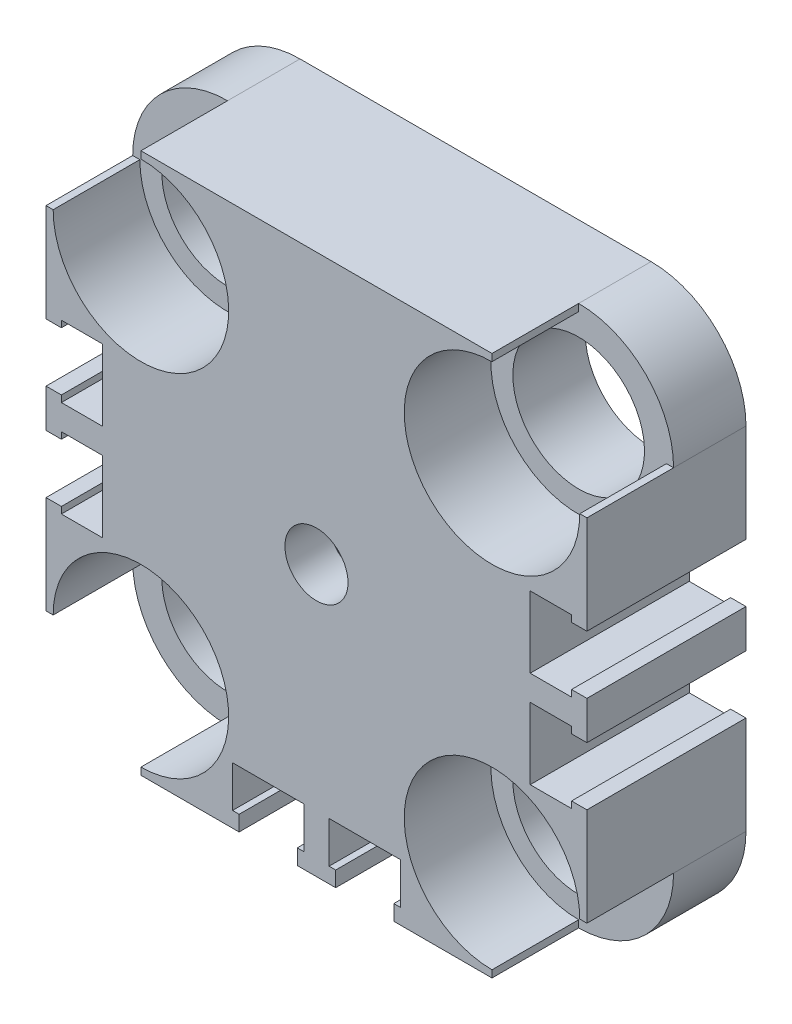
from build123d import *

# Parameters (mm, degrees)
EXTRUSION1_DEPTH                    = 14.5
ENL_V_MAT_EXTRU_1_DEPTH             = 7.9
ESQUISSE3_R                         = 6
ENL_V_MAT_EXTRU_2_DEPTH             = 7.9
R_P_TITION_CIRCULAIRE1_COUNT        = 4
ESQUISSE4_R                         = 2.875
ENL_V_MAT_EXTRU_3_DEPTH             = 4
ENL_V_MAT_EXTRU_4_DEPTH             = 38.755728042
R_P_TITION_CIRCULAIRE2_COUNT        = 3
R_P_TITION_CIRCULAIRE2_ANGLE        = 180
R_P_TITION_CIRCULAIRE2_COPY_1_DEPTH = 38.755728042
R_P_TITION_CIRCULAIRE2_COPY_2_DEPTH = 38.755728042


with BuildPart() as part:
    # Esquisse1 → Extrusion1 (new body)
    with BuildSketch(Plane.XY):
        with BuildLine():
            Line((-16, 24.65), (16, 24.65))
            ThreePointArc((16, 24.65), (22.116473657, 22.116473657), (24.65, 16))
            Line((24.65, 16), (24.65, -16))
            ThreePointArc((24.65, -16), (22.116473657, -22.116473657), (16, -24.65))
            Line((16, -24.65), (-16, -24.65))
            ThreePointArc((-16, -24.65), (-22.116473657, -22.116473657), (-24.65, -16))
            Line((-24.65, -16), (-24.65, 16))
            ThreePointArc((-24.65, 16), (-22.116473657, 22.116473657), (-16, 24.65))
        make_face()
    extrude(amount=-EXTRUSION1_DEPTH)

    # Esquisse2 → Enl_v. mat.-Extru.1 (cut)
    with BuildSketch(Plane.XY):
        with BuildLine():
            Line((-16, 24), (-16, 24.65))
            ThreePointArc((-16, 24.65), (-22.116473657, 22.116473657), (-24.65, 16))
            Line((-24.65, 16), (-24, 16))
            ThreePointArc((-24, 16), (-10.343145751, 10.343145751), (-16, 24))
        make_face()
    enl_v_mat_extru_1 = extrude(amount=-ENL_V_MAT_EXTRU_1_DEPTH, mode=Mode.SUBTRACT)

    # Esquisse3 → Enl_v. mat.-Extru.2 (cut)
    with BuildSketch(Plane.XY.offset(-7.9)):
        with Locations((-16, 16)):
            Circle(ESQUISSE3_R)
    enl_v_mat_extru_2 = extrude(amount=-ENL_V_MAT_EXTRU_2_DEPTH, mode=Mode.SUBTRACT)

    # R_p_tition circulaire1: Enl_v. mat.-Extru.1, Enl_v. mat.-Extru.2 ×4 about axis
    r_p_tition_circulaire1_axis = Axis((0, 0, 0), (0, 0, 1))
    add([enl_v_mat_extru_1.rotate(r_p_tition_circulaire1_axis, i * 360 / R_P_TITION_CIRCULAIRE1_COUNT) for i in range(1, R_P_TITION_CIRCULAIRE1_COUNT)], mode=Mode.SUBTRACT)
    add([enl_v_mat_extru_2.rotate(r_p_tition_circulaire1_axis, i * 360 / R_P_TITION_CIRCULAIRE1_COUNT) for i in range(1, R_P_TITION_CIRCULAIRE1_COUNT)], mode=Mode.SUBTRACT)

    # Esquisse4 → Enl_v. mat.-Extru.3 (cut)
    with BuildSketch(Plane.XY):
        Circle(ESQUISSE4_R)
    extrude(amount=-ENL_V_MAT_EXTRU_3_DEPTH, mode=Mode.SUBTRACT)

    # Esquisse6 → Enl_v. mat.-Extru.4 (cut, through all)
    with BuildSketch(Plane.XY):
        Polygon((-24.65, 7.05), (-23.25, 7.05), (-23.25, 7.65), (-19.48, 7.65), (-19.48, 1.15), (-23.25, 1.15), (-23.25, 1.75), (-24.65, 1.75), align=None)
    enl_v_mat_extru_4 = extrude(amount=-ENL_V_MAT_EXTRU_4_DEPTH, mode=Mode.SUBTRACT)

    # Sym_trie1: Enl_v. mat.-Extru.4 across plane
    add(enl_v_mat_extru_4.mirror(Plane.ZX), mode=Mode.SUBTRACT)

    # R_p_tition circulaire2: Enl_v. mat.-Extru.4 ×3 about axis
    r_p_tition_circulaire2_axis = Axis((0, 0, 0), (0, 0, 1))
    for i in range(1, R_P_TITION_CIRCULAIRE2_COUNT):
        add(enl_v_mat_extru_4.rotate(r_p_tition_circulaire2_axis, i * R_P_TITION_CIRCULAIRE2_ANGLE / (R_P_TITION_CIRCULAIRE2_COUNT - 1)), mode=Mode.SUBTRACT)

    # R_p_tition circulaire2 copy 1 sketch → R_p_tition circulaire2 copy 1 (cut, through all)
    with BuildSketch(Plane(origin=(0, 0, 0), x_dir=(0, 1, 0), z_dir=(0, 0, 1))):
        Polygon((-24.65, -7.05), (-23.25, -7.05), (-23.25, -7.65), (-19.48, -7.65), (-19.48, -1.15), (-23.25, -1.15), (-23.25, -1.75), (-24.65, -1.75), align=None)
    extrude(amount=-R_P_TITION_CIRCULAIRE2_COPY_1_DEPTH, mode=Mode.SUBTRACT)

    # R_p_tition circulaire2 copy 2 sketch → R_p_tition circulaire2 copy 2 (cut, through all)
    with BuildSketch(Plane(origin=(0, 0, 0), x_dir=(-1, 0, 0), z_dir=(0, 0, 1))):
        Polygon((-24.65, -7.05), (-23.25, -7.05), (-23.25, -7.65), (-19.48, -7.65), (-19.48, -1.15), (-23.25, -1.15), (-23.25, -1.75), (-24.65, -1.75), align=None)
    extrude(amount=-R_P_TITION_CIRCULAIRE2_COPY_2_DEPTH, mode=Mode.SUBTRACT)


solid = part.part
